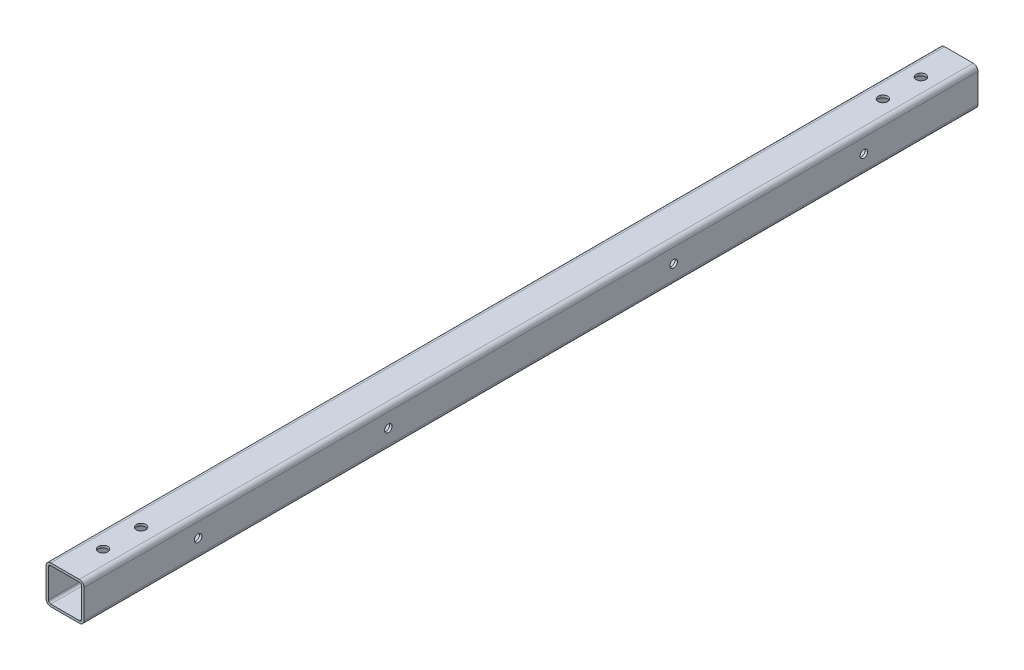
from build123d import *

# Parameters (mm, degrees)
SKETCH1_W          = 25.4
SKETCH1_H          = 25.4
BASE_EXTRUDE_DEPTH = 298.45
FILLET1_R          = 3.175
SHELL1_T           = -1.5875
SKETCH4_R          = 3.175
CUT_EXTRUDE1_DEPTH = 300.798019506
CUT_EXTRUDE3_REACH = 301.668
SKETCH6_R          = 2.5


with BuildPart() as part:
    # Sketch1 → Base-Extrude (new, symmetric)
    with BuildSketch(Plane.XY):
        Rectangle(SKETCH1_W, SKETCH1_H)
    extrude(amount=BASE_EXTRUDE_DEPTH, both=True)

    # Fillet1
    fillet1_edges = [part.edges().sort_by_distance(p)[0] for p in [
        (-12.7, 12.7, 0),
        (12.7, 12.7, 0),
        (12.7, -12.7, 0),
        (-12.7, -12.7, 0),
    ]]
    fillet(fillet1_edges, radius=FILLET1_R)

    # Shell1
    shell1_openings = [part.faces().sort_by_distance(p)[0] for p in [
        (0, 0, 298.45),
        (0, 0, -298.45),
    ]]
    offset(amount=SHELL1_T, openings=shell1_openings, kind=Kind.INTERSECTION)

    # Sketch4 → Cut-Extrude1 (cut, through all)
    with BuildSketch(Plane.XZ.offset(12.7)):
        with Locations((0, 273.05)):
            Circle(SKETCH4_R)
        with Locations((0, 247.65)):
            Circle(SKETCH4_R)
        with Locations((0, -247.65)):
            Circle(SKETCH4_R)
        with Locations((0, -273.05)):
            Circle(SKETCH4_R)
    extrude(amount=-CUT_EXTRUDE1_DEPTH, mode=Mode.SUBTRACT)

    # Sketch6 → Cut-Extrude3 (cut, up to next)
    with BuildSketch(Plane.ZY.offset(-11.1125), mode=Mode.PRIVATE) as cut_extrude3_sk1:
        with Locations((-95.25, 0)):
            Circle(SKETCH6_R)
    cut_extrude3_tool1 = extrude(cut_extrude3_sk1.sketch, amount=-CUT_EXTRUDE3_REACH, mode=Mode.PRIVATE) & part.part
    # Sketch6 → Cut-Extrude3 (cut, up to next)
    with BuildSketch(Plane.ZY.offset(-11.1125), mode=Mode.PRIVATE) as cut_extrude3_sk2:
        with Locations((-222.25, 0)):
            Circle(SKETCH6_R)
    cut_extrude3_tool2 = extrude(cut_extrude3_sk2.sketch, amount=-CUT_EXTRUDE3_REACH, mode=Mode.PRIVATE) & part.part
    # Sketch6 → Cut-Extrude3 (cut, up to next)
    with BuildSketch(Plane.ZY.offset(-11.1125), mode=Mode.PRIVATE) as cut_extrude3_sk3:
        with Locations((222.25, 0)):
            Circle(SKETCH6_R)
    cut_extrude3_tool3 = extrude(cut_extrude3_sk3.sketch, amount=-CUT_EXTRUDE3_REACH, mode=Mode.PRIVATE) & part.part
    # Sketch6 → Cut-Extrude3 (cut, up to next)
    with BuildSketch(Plane.ZY.offset(-11.1125), mode=Mode.PRIVATE) as cut_extrude3_sk4:
        with Locations((95.25, 0)):
            Circle(SKETCH6_R)
    cut_extrude3_tool4 = extrude(cut_extrude3_sk4.sketch, amount=-CUT_EXTRUDE3_REACH, mode=Mode.PRIVATE) & part.part
    add(cut_extrude3_tool1.solids().sort_by_distance((11.1125, 0, -95.25))[0], mode=Mode.SUBTRACT)
    add(cut_extrude3_tool2.solids().sort_by_distance((11.1125, 0, -222.25))[0], mode=Mode.SUBTRACT)
    add(cut_extrude3_tool3.solids().sort_by_distance((11.1125, 0, 222.25))[0], mode=Mode.SUBTRACT)
    add(cut_extrude3_tool4.solids().sort_by_distance((11.1125, 0, 95.25))[0], mode=Mode.SUBTRACT)


solid = part.part
